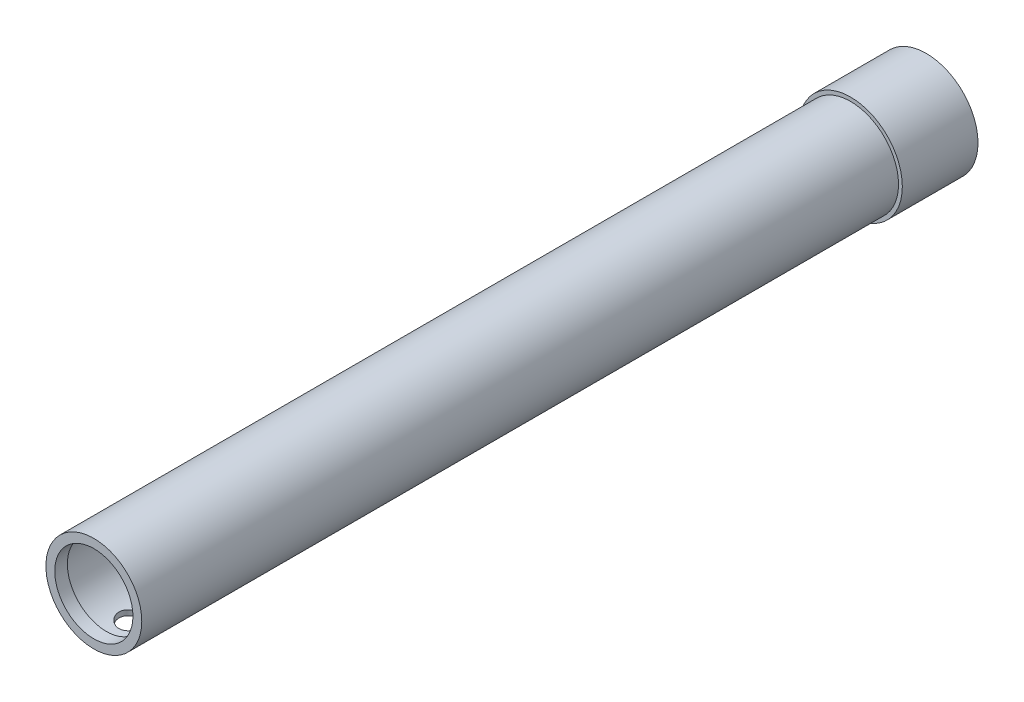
ISO-10303-21;
HEADER;
FILE_DESCRIPTION(('STEP AP214'),'2;1');
FILE_NAME('part.step','',(''),(''),'','','');
FILE_SCHEMA(('AUTOMOTIVE_DESIGN { 1 0 10303 214 1 1 1 1 }'));
ENDSEC;
DATA;
#1=APPLICATION_CONTEXT('core data for automotive mechanical design processes');
#2=APPLICATION_PROTOCOL_DEFINITION('international standard','automotive_design',2000,#1);
#3=PRODUCT_CONTEXT('',#1,'mechanical');
#4=PRODUCT('Part','Part','',(#3));
#5=PRODUCT_RELATED_PRODUCT_CATEGORY('part','',(#4));
#6=PRODUCT_DEFINITION_FORMATION('','',#4);
#7=PRODUCT_DEFINITION_CONTEXT('part definition',#1,'design');
#8=PRODUCT_DEFINITION('design','',#6,#7);
#9=PRODUCT_DEFINITION_SHAPE('','',#8);
#10=(LENGTH_UNIT() NAMED_UNIT(*) SI_UNIT(.MILLI.,.METRE.));
#11=(NAMED_UNIT(*) PLANE_ANGLE_UNIT() SI_UNIT($,.RADIAN.));
#12=(NAMED_UNIT(*) SI_UNIT($,.STERADIAN.) SOLID_ANGLE_UNIT());
#13=UNCERTAINTY_MEASURE_WITH_UNIT(LENGTH_MEASURE(1.E-05),#10,'distance_accuracy_value','');
#14=(GEOMETRIC_REPRESENTATION_CONTEXT(3) GLOBAL_UNCERTAINTY_ASSIGNED_CONTEXT((#13)) GLOBAL_UNIT_ASSIGNED_CONTEXT((#10,
#11,#12)) REPRESENTATION_CONTEXT('',''));
#15=CARTESIAN_POINT('',(0.,0.,0.));
#16=DIRECTION('',(0.,0.,1.));
#17=DIRECTION('',(1.,0.,0.));
#18=AXIS2_PLACEMENT_3D('',#15,#16,#17);
#19=CARTESIAN_POINT('',(0.,0.,300.));
#20=DIRECTION('',(0.,0.,-1.));
#21=DIRECTION('',(-1.,0.,0.));
#22=AXIS2_PLACEMENT_3D('',#19,#20,#21);
#23=CYLINDRICAL_SURFACE('',#22,19.);
#24=CARTESIAN_POINT('',(0.,-19.,290.));
#25=CARTESIAN_POINT('',(0.275769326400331,-18.9999957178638,289.999993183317));
#26=CARTESIAN_POINT('',(0.551612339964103,-18.9939369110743,289.977108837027));
#27=CARTESIAN_POINT('',(1.09536084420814,-18.9703552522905,289.886332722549));
#28=CARTESIAN_POINT('',(1.36326229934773,-18.9528266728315,289.81841846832));
#29=CARTESIAN_POINT('',(1.88319959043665,-18.9082415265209,289.639936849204));
#30=CARTESIAN_POINT('',(2.13525511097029,-18.8811970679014,289.529423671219));
#31=CARTESIAN_POINT('',(2.61725305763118,-18.8204430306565,289.269079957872));
#32=CARTESIAN_POINT('',(2.84719416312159,-18.7867330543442,289.119247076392));
#33=CARTESIAN_POINT('',(3.2836398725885,-18.7154388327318,288.780936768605));
#34=CARTESIAN_POINT('',(3.48957269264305,-18.6777897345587,288.591735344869));
#35=CARTESIAN_POINT('',(3.86718169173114,-18.6032800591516,288.181606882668));
#36=CARTESIAN_POINT('',(4.03885358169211,-18.5664195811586,287.960675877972));
#37=CARTESIAN_POINT('',(4.34583417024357,-18.4969993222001,287.488822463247));
#38=CARTESIAN_POINT('',(4.48048899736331,-18.4645214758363,287.237461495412));
#39=CARTESIAN_POINT('',(4.7054029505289,-18.4084956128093,286.714675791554));
#40=CARTESIAN_POINT('',(4.79567002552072,-18.3849459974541,286.443254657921));
#41=CARTESIAN_POINT('',(4.92726790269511,-18.3501118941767,285.894376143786));
#42=CARTESIAN_POINT('',(4.96963355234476,-18.3385684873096,285.617183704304));
#43=CARTESIAN_POINT('',(5.00745164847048,-18.328279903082,285.059403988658));
#44=CARTESIAN_POINT('',(5.00291261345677,-18.3295324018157,284.778817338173));
#45=CARTESIAN_POINT('',(4.94787263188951,-18.3444621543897,284.230259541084));
#46=CARTESIAN_POINT('',(4.89861973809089,-18.3578020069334,283.962152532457));
#47=CARTESIAN_POINT('',(4.75754734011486,-18.3948637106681,283.438147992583));
#48=CARTESIAN_POINT('',(4.66572451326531,-18.4185863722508,283.182251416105));
#49=CARTESIAN_POINT('',(4.44109179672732,-18.4740402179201,282.68665842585));
#50=CARTESIAN_POINT('',(4.30784106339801,-18.5058568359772,282.447171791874));
#51=CARTESIAN_POINT('',(4.00444274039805,-18.573867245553,281.993517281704));
#52=CARTESIAN_POINT('',(3.83428805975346,-18.6100618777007,281.779354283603));
#53=CARTESIAN_POINT('',(3.45551254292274,-18.6841580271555,281.375291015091));
#54=CARTESIAN_POINT('',(3.24584253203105,-18.7220772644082,281.186376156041));
#55=CARTESIAN_POINT('',(2.79733618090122,-18.794319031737,280.846190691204));
#56=CARTESIAN_POINT('',(2.55849875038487,-18.828641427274,280.694921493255));
#57=CARTESIAN_POINT('',(2.05693717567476,-18.8900243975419,280.433903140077));
#58=CARTESIAN_POINT('',(1.79411828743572,-18.9170543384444,280.324328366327));
#59=CARTESIAN_POINT('',(1.25291705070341,-18.9605851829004,280.151199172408));
#60=CARTESIAN_POINT('',(0.974538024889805,-18.9770883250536,280.087634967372));
#61=CARTESIAN_POINT('',(0.418531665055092,-18.9973691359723,280.009869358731));
#62=CARTESIAN_POINT('',(0.14110409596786,-19.0014922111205,279.994327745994));
#63=CARTESIAN_POINT('',(-0.412392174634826,-18.9975393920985,280.009352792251));
#64=CARTESIAN_POINT('',(-0.688461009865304,-18.9894647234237,280.039914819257));
#65=CARTESIAN_POINT('',(-1.22664703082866,-18.9622464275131,280.145179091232));
#66=CARTESIAN_POINT('',(-1.48892004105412,-18.9432894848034,280.21913734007));
#67=CARTESIAN_POINT('',(-1.99731390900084,-18.8964538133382,280.408233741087));
#68=CARTESIAN_POINT('',(-2.24343303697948,-18.8685741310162,280.523376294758));
#69=CARTESIAN_POINT('',(-2.71776721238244,-18.8061722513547,280.794082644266));
#70=CARTESIAN_POINT('',(-2.9455476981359,-18.7715327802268,280.950380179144));
#71=CARTESIAN_POINT('',(-3.37211945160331,-18.6996172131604,281.298034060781));
#72=CARTESIAN_POINT('',(-3.57090513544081,-18.6623406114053,281.489397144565));
#73=CARTESIAN_POINT('',(-3.93946537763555,-18.5880870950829,281.907998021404));
#74=CARTESIAN_POINT('',(-4.10829545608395,-18.5511463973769,282.136075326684));
#75=CARTESIAN_POINT('',(-4.40530154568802,-18.4828739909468,282.618100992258));
#76=CARTESIAN_POINT('',(-4.53347928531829,-18.451542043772,282.872048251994));
#77=CARTESIAN_POINT('',(-4.74457728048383,-18.3983923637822,283.39731246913));
#78=CARTESIAN_POINT('',(-4.82776168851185,-18.3765192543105,283.668517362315));
#79=CARTESIAN_POINT('',(-4.94715371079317,-18.3447420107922,284.22173645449));
#80=CARTESIAN_POINT('',(-4.98337294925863,-18.3348349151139,284.50374796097));
#81=CARTESIAN_POINT('',(-5.00715081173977,-18.3283542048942,285.060918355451));
#82=CARTESIAN_POINT('',(-4.99622557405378,-18.3313651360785,285.336008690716));
#83=CARTESIAN_POINT('',(-4.9295314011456,-18.3494111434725,285.880276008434));
#84=CARTESIAN_POINT('',(-4.87376356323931,-18.3644459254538,286.149453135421));
#85=CARTESIAN_POINT('',(-4.71983552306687,-18.404601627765,286.672400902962));
#86=CARTESIAN_POINT('',(-4.62198864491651,-18.4296479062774,286.926269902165));
#87=CARTESIAN_POINT('',(-4.38692411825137,-18.487008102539,287.414178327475));
#88=CARTESIAN_POINT('',(-4.24970044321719,-18.5193231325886,287.648214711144));
#89=CARTESIAN_POINT('',(-3.93514861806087,-18.5887388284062,288.097070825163));
#90=CARTESIAN_POINT('',(-3.75678207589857,-18.6259502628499,288.311145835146));
#91=CARTESIAN_POINT('',(-3.36699304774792,-18.7003384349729,288.706818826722));
#92=CARTESIAN_POINT('',(-3.15556257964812,-18.7375151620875,288.888408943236));
#93=CARTESIAN_POINT('',(-2.70037417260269,-18.8085635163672,289.217640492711));
#94=CARTESIAN_POINT('',(-2.45603841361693,-18.8423509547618,289.36450271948));
#95=CARTESIAN_POINT('',(-1.94526775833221,-18.9019003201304,289.614834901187));
#96=CARTESIAN_POINT('',(-1.67884754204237,-18.9276675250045,289.718333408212));
#97=CARTESIAN_POINT('',(-1.1777515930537,-18.9648374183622,289.865096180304));
#98=CARTESIAN_POINT('',(-0.945286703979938,-18.9779285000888,289.915569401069));
#99=CARTESIAN_POINT('',(-0.475232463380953,-18.9955112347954,289.983022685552));
#100=CARTESIAN_POINT('',(-0.237643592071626,-19.0000036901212,290.000005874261));
#101=CARTESIAN_POINT('',(0.,-19.,290.));
#102=B_SPLINE_CURVE_WITH_KNOTS('',3,(#24,#25,#26,#27,#28,#29,#30,#31,#32,#33,#34,#35,#36,#37,
#38,#39,#40,#41,#42,#43,#44,#45,#46,#47,#48,#49,#50,#51,#52,#53,#54,#55,#56,#57,#58,#59,#60,#61,
#62,#63,#64,#65,#66,#67,#68,#69,#70,#71,#72,#73,#74,#75,#76,#77,#78,#79,#80,#81,#82,#83,#84,#85,
#86,#87,#88,#89,#90,#91,#92,#93,#94,#95,#96,#97,#98,#99,#100,#101),.UNSPECIFIED.,.T.,.F.,(4,2,2,
2,2,2,2,2,2,2,2,2,2,2,2,2,2,2,2,2,2,2,2,2,2,2,2,2,2,2,2,2,2,2,2,2,2,2,4),(0.,0.826436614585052,
1.65328622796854,2.47908752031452,3.30493809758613,4.14758534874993,4.99033802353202,
5.84713921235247,6.70378690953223,7.54155141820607,8.37916378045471,9.19409222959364,
10.0090842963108,10.8330642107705,11.6572025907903,12.5074895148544,13.35780823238,
14.2116451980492,15.0653005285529,15.8949065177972,16.7244291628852,17.5401294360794,
18.3559169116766,19.187369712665,20.0189824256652,20.873388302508,21.7277578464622,
22.5770554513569,23.4261428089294,24.2481310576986,25.0700991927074,25.8860500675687,
26.7021258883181,27.5416338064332,28.3813447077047,29.2384104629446,30.0949110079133,
30.8071573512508,31.5193372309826),.UNSPECIFIED.);
#103=CARTESIAN_POINT('',(0.,-19.,290.));
#104=VERTEX_POINT('',#103);
#105=EDGE_CURVE('E82',#104,#104,#102,.T.);
#106=ORIENTED_EDGE('',*,*,#105,.T.);
#107=EDGE_LOOP('',(#106));
#108=FACE_BOUND('',#107,.T.);
#109=CARTESIAN_POINT('',(0.,0.,300.));
#110=DIRECTION('',(0.,0.,1.));
#111=DIRECTION('',(1.,0.,0.));
#112=AXIS2_PLACEMENT_3D('',#109,#110,#111);
#113=CIRCLE('',#112,19.);
#114=CARTESIAN_POINT('',(19.,0.,300.));
#115=VERTEX_POINT('',#114);
#116=EDGE_CURVE('E53',#115,#115,#113,.T.);
#117=ORIENTED_EDGE('',*,*,#116,.F.);
#118=EDGE_LOOP('',(#117));
#119=FACE_BOUND('',#118,.T.);
#120=CARTESIAN_POINT('',(0.,0.,0.));
#121=DIRECTION('',(0.,0.,1.));
#122=DIRECTION('',(1.,0.,0.));
#123=AXIS2_PLACEMENT_3D('',#120,#121,#122);
#124=CIRCLE('',#123,19.);
#125=CARTESIAN_POINT('',(19.,0.,0.));
#126=VERTEX_POINT('',#125);
#127=EDGE_CURVE('E58',#126,#126,#124,.T.);
#128=ORIENTED_EDGE('',*,*,#127,.T.);
#129=EDGE_LOOP('',(#128));
#130=FACE_BOUND('',#129,.T.);
#131=ADVANCED_FACE('F39',(#108,#119,#130),#23,.T.);
#132=CARTESIAN_POINT('',(0.,0.,300.));
#133=DIRECTION('',(0.,0.,1.));
#134=DIRECTION('',(1.,0.,0.));
#135=AXIS2_PLACEMENT_3D('',#132,#133,#134);
#136=PLANE('',#135);
#137=ORIENTED_EDGE('',*,*,#116,.T.);
#138=EDGE_LOOP('',(#137));
#139=FACE_BOUND('',#138,.T.);
#140=CARTESIAN_POINT('',(0.,0.,300.));
#141=DIRECTION('',(0.,0.,1.));
#142=DIRECTION('',(1.,0.,0.));
#143=AXIS2_PLACEMENT_3D('',#140,#141,#142);
#144=CIRCLE('',#143,15.5);
#145=CARTESIAN_POINT('',(15.5,0.,300.));
#146=VERTEX_POINT('',#145);
#147=EDGE_CURVE('E78',#146,#146,#144,.T.);
#148=ORIENTED_EDGE('',*,*,#147,.F.);
#149=EDGE_LOOP('',(#148));
#150=FACE_BOUND('',#149,.T.);
#151=ADVANCED_FACE('F124',(#139,#150),#136,.T.);
#152=CARTESIAN_POINT('',(0.,0.,-30.));
#153=DIRECTION('',(0.,0.,1.));
#154=DIRECTION('',(1.,0.,0.));
#155=AXIS2_PLACEMENT_3D('',#152,#153,#154);
#156=CYLINDRICAL_SURFACE('',#155,20.5);
#157=CARTESIAN_POINT('',(0.,0.,-30.));
#158=DIRECTION('',(0.,0.,1.));
#159=DIRECTION('',(1.,0.,0.));
#160=AXIS2_PLACEMENT_3D('',#157,#158,#159);
#161=CIRCLE('',#160,20.5);
#162=CARTESIAN_POINT('',(20.5,0.,-30.));
#163=VERTEX_POINT('',#162);
#164=EDGE_CURVE('E63',#163,#163,#161,.T.);
#165=ORIENTED_EDGE('',*,*,#164,.T.);
#166=EDGE_LOOP('',(#165));
#167=FACE_BOUND('',#166,.T.);
#168=CARTESIAN_POINT('',(0.,0.,0.));
#169=DIRECTION('',(0.,0.,1.));
#170=DIRECTION('',(1.,0.,0.));
#171=AXIS2_PLACEMENT_3D('',#168,#169,#170);
#172=CIRCLE('',#171,20.5);
#173=CARTESIAN_POINT('',(20.5,0.,0.));
#174=VERTEX_POINT('',#173);
#175=EDGE_CURVE('E65',#174,#174,#172,.T.);
#176=ORIENTED_EDGE('',*,*,#175,.F.);
#177=EDGE_LOOP('',(#176));
#178=FACE_BOUND('',#177,.T.);
#179=ADVANCED_FACE('F118',(#167,#178),#156,.T.);
#180=CARTESIAN_POINT('',(0.,0.,-30.));
#181=DIRECTION('',(0.,0.,1.));
#182=DIRECTION('',(1.,0.,0.));
#183=AXIS2_PLACEMENT_3D('',#180,#181,#182);
#184=PLANE('',#183);
#185=CARTESIAN_POINT('',(0.,0.,-30.));
#186=DIRECTION('',(0.,0.,-1.));
#187=DIRECTION('',(-1.,0.,0.));
#188=AXIS2_PLACEMENT_3D('',#185,#186,#187);
#189=CIRCLE('',#188,17.25);
#190=CARTESIAN_POINT('',(-17.25,0.,-30.));
#191=VERTEX_POINT('',#190);
#192=EDGE_CURVE('E196',#191,#191,#189,.T.);
#193=ORIENTED_EDGE('',*,*,#192,.F.);
#194=EDGE_LOOP('',(#193));
#195=FACE_BOUND('',#194,.T.);
#196=ORIENTED_EDGE('',*,*,#164,.F.);
#197=EDGE_LOOP('',(#196));
#198=FACE_BOUND('',#197,.T.);
#199=ADVANCED_FACE('F115',(#195,#198),#184,.F.);
#200=CARTESIAN_POINT('',(0.,0.,0.));
#201=DIRECTION('',(0.,0.,1.));
#202=DIRECTION('',(1.,0.,0.));
#203=AXIS2_PLACEMENT_3D('',#200,#201,#202);
#204=PLANE('',#203);
#205=ORIENTED_EDGE('',*,*,#127,.F.);
#206=EDGE_LOOP('',(#205));
#207=FACE_BOUND('',#206,.T.);
#208=ORIENTED_EDGE('',*,*,#175,.T.);
#209=EDGE_LOOP('',(#208));
#210=FACE_BOUND('',#209,.T.);
#211=ADVANCED_FACE('F109',(#207,#210),#204,.T.);
#212=CARTESIAN_POINT('',(0.,0.,295.));
#213=DIRECTION('',(0.,0.,1.));
#214=DIRECTION('',(1.,0.,0.));
#215=AXIS2_PLACEMENT_3D('',#212,#213,#214);
#216=PLANE('',#215);
#217=CARTESIAN_POINT('',(0.,0.,295.));
#218=DIRECTION('',(0.,0.,1.));
#219=DIRECTION('',(1.,0.,0.));
#220=AXIS2_PLACEMENT_3D('',#217,#218,#219);
#221=CIRCLE('',#220,15.5);
#222=CARTESIAN_POINT('',(15.5,0.,295.));
#223=VERTEX_POINT('',#222);
#224=EDGE_CURVE('E69',#223,#223,#221,.T.);
#225=ORIENTED_EDGE('',*,*,#224,.T.);
#226=EDGE_LOOP('',(#225));
#227=FACE_BOUND('',#226,.T.);
#228=CARTESIAN_POINT('',(0.,0.,295.));
#229=DIRECTION('',(0.,0.,1.));
#230=DIRECTION('',(1.,0.,0.));
#231=AXIS2_PLACEMENT_3D('',#228,#229,#230);
#232=CIRCLE('',#231,17.);
#233=CARTESIAN_POINT('',(17.,0.,295.));
#234=VERTEX_POINT('',#233);
#235=EDGE_CURVE('E10',#234,#234,#232,.F.);
#236=ORIENTED_EDGE('',*,*,#235,.T.);
#237=EDGE_LOOP('',(#236));
#238=FACE_BOUND('',#237,.T.);
#239=ADVANCED_FACE('F106',(#227,#238),#216,.F.);
#240=CARTESIAN_POINT('',(0.,0.,295.));
#241=DIRECTION('',(0.,0.,1.));
#242=DIRECTION('',(1.,0.,0.));
#243=AXIS2_PLACEMENT_3D('',#240,#241,#242);
#244=CYLINDRICAL_SURFACE('',#243,15.5);
#245=ORIENTED_EDGE('',*,*,#224,.F.);
#246=EDGE_LOOP('',(#245));
#247=FACE_BOUND('',#246,.T.);
#248=ORIENTED_EDGE('',*,*,#147,.T.);
#249=EDGE_LOOP('',(#248));
#250=FACE_BOUND('',#249,.T.);
#251=ADVANCED_FACE('F102',(#247,#250),#244,.F.);
#252=CARTESIAN_POINT('',(0.,0.,0.));
#253=DIRECTION('',(0.,0.,1.));
#254=DIRECTION('',(1.,0.,0.));
#255=AXIS2_PLACEMENT_3D('',#252,#253,#254);
#256=CYLINDRICAL_SURFACE('',#255,17.);
#257=CARTESIAN_POINT('',(0.,-17.,290.));
#258=CARTESIAN_POINT('',(-0.274542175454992,-16.9999972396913,289.999996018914));
#259=CARTESIAN_POINT('',(-0.549124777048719,-16.9932854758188,289.977312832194));
#260=CARTESIAN_POINT('',(-1.09030958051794,-16.9671658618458,289.887384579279));
#261=CARTESIAN_POINT('',(-1.35690910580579,-16.9477538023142,289.820124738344));
#262=CARTESIAN_POINT('',(-1.87424279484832,-16.8983635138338,289.643471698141));
#263=CARTESIAN_POINT('',(-2.12499922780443,-16.8684005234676,289.534139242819));
#264=CARTESIAN_POINT('',(-2.60462027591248,-16.8010321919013,289.276689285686));
#265=CARTESIAN_POINT('',(-2.83348222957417,-16.7636259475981,289.128567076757));
#266=CARTESIAN_POINT('',(-3.26915832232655,-16.6842112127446,288.793416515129));
#267=CARTESIAN_POINT('',(-3.47528005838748,-16.6421111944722,288.605509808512));
#268=CARTESIAN_POINT('',(-3.85358695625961,-16.558607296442,288.197997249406));
#269=CARTESIAN_POINT('',(-4.02576667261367,-16.5172035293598,287.978386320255));
#270=CARTESIAN_POINT('',(-4.33489560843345,-16.4388177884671,287.507902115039));
#271=CARTESIAN_POINT('',(-4.47100870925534,-16.4019498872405,287.256458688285));
#272=CARTESIAN_POINT('',(-4.69873934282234,-16.3381741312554,286.732992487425));
#273=CARTESIAN_POINT('',(-4.79036709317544,-16.311263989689,286.460974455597));
#274=CARTESIAN_POINT('',(-4.92404618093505,-16.2714028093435,285.911837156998));
#275=CARTESIAN_POINT('',(-4.96737026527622,-16.2580942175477,285.635054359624));
#276=CARTESIAN_POINT('',(-5.0071854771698,-16.245878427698,285.077853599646));
#277=CARTESIAN_POINT('',(-5.00368745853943,-16.2469678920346,284.797436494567));
#278=CARTESIAN_POINT('',(-4.95095940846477,-16.2631076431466,284.251198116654));
#279=CARTESIAN_POINT('',(-4.90331354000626,-16.2776742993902,283.985207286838));
#280=CARTESIAN_POINT('',(-4.76619765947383,-16.3183462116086,283.465174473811));
#281=CARTESIAN_POINT('',(-4.67672366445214,-16.3444525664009,283.211133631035));
#282=CARTESIAN_POINT('',(-4.45730211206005,-16.4056554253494,282.718290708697));
#283=CARTESIAN_POINT('',(-4.326833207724,-16.4408666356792,282.479735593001));
#284=CARTESIAN_POINT('',(-4.02948792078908,-16.5162554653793,282.02736924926));
#285=CARTESIAN_POINT('',(-3.86260301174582,-16.5564342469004,281.813563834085));
#286=CARTESIAN_POINT('',(-3.48925235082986,-16.6392021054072,281.407768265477));
#287=CARTESIAN_POINT('',(-3.28146894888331,-16.6818232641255,281.216994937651));
#288=CARTESIAN_POINT('',(-2.8363291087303,-16.7632443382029,280.87272397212));
#289=CARTESIAN_POINT('',(-2.59897095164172,-16.8020440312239,280.719228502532));
#290=CARTESIAN_POINT('',(-2.09926848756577,-16.8717818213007,280.453169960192));
#291=CARTESIAN_POINT('',(-1.83677785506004,-16.9026694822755,280.340867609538));
#292=CARTESIAN_POINT('',(-1.29551766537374,-16.9527396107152,280.16235794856));
#293=CARTESIAN_POINT('',(-1.01675248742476,-16.9719252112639,280.096138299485));
#294=CARTESIAN_POINT('',(-0.461208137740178,-16.9959379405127,280.013678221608));
#295=CARTESIAN_POINT('',(-0.184693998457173,-17.0012389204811,279.995787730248));
#296=CARTESIAN_POINT('',(0.367399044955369,-16.9982701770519,280.005881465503));
#297=CARTESIAN_POINT('',(0.64297806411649,-16.9900021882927,280.033859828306));
#298=CARTESIAN_POINT('',(1.17921271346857,-16.961134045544,280.1335588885));
#299=CARTESIAN_POINT('',(1.44006199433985,-16.9408036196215,280.204323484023));
#300=CARTESIAN_POINT('',(1.9461351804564,-16.8901536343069,280.386443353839));
#301=CARTESIAN_POINT('',(2.19135723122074,-16.8598328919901,280.497803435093));
#302=CARTESIAN_POINT('',(2.66534944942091,-16.7915033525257,280.760775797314));
#303=CARTESIAN_POINT('',(2.8936244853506,-16.7533367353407,280.913238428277));
#304=CARTESIAN_POINT('',(3.32191560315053,-16.673704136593,281.253048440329));
#305=CARTESIAN_POINT('',(3.52192485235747,-16.6322373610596,281.440404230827));
#306=CARTESIAN_POINT('',(3.89521688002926,-16.5488725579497,281.852428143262));
#307=CARTESIAN_POINT('',(4.06732704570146,-16.5070097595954,282.078168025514));
#308=CARTESIAN_POINT('',(4.37129517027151,-16.4291353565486,282.556232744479));
#309=CARTESIAN_POINT('',(4.50315434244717,-16.3931235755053,282.808556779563));
#310=CARTESIAN_POINT('',(4.72194711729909,-16.3314467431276,283.331714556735));
#311=CARTESIAN_POINT('',(4.80910325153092,-16.3057305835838,283.60244886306));
#312=CARTESIAN_POINT('',(4.93634927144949,-16.26766584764,284.155642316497));
#313=CARTESIAN_POINT('',(4.97645449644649,-16.2553129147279,284.438097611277));
#314=CARTESIAN_POINT('',(5.00744547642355,-16.2457908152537,284.994567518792));
#315=CARTESIAN_POINT('',(5.00023747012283,-16.2480335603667,285.268467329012));
#316=CARTESIAN_POINT('',(4.94133317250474,-16.2660429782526,285.810964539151));
#317=CARTESIAN_POINT('',(4.88963853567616,-16.2818091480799,286.079562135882));
#318=CARTESIAN_POINT('',(4.74443717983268,-16.3247022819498,286.600847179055));
#319=CARTESIAN_POINT('',(4.65141659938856,-16.3516969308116,286.853681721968));
#320=CARTESIAN_POINT('',(4.42658103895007,-16.413985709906,287.340356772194));
#321=CARTESIAN_POINT('',(4.29475886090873,-16.4492813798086,287.574193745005));
#322=CARTESIAN_POINT('',(3.99063021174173,-16.525744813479,288.025129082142));
#323=CARTESIAN_POINT('',(3.81706300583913,-16.5670754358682,288.241349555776));
#324=CARTESIAN_POINT('',(3.43666397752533,-16.6501406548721,288.64221382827));
#325=CARTESIAN_POINT('',(3.2298236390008,-16.6918753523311,288.826849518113));
#326=CARTESIAN_POINT('',(2.78184131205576,-16.7724327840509,289.164392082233));
#327=CARTESIAN_POINT('',(2.53990743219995,-16.8111427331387,289.316277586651));
#328=CARTESIAN_POINT('',(2.03279874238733,-16.8799593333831,289.576998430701));
#329=CARTESIAN_POINT('',(1.76763565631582,-16.9100702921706,289.685855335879));
#330=CARTESIAN_POINT('',(1.25377523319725,-16.9554297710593,289.846835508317));
#331=CARTESIAN_POINT('',(1.00680227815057,-16.97200860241,289.90412084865));
#332=CARTESIAN_POINT('',(0.506563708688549,-16.9942941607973,289.980702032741));
#333=CARTESIAN_POINT('',(0.253299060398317,-17.0000025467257,290.000003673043));
#334=CARTESIAN_POINT('',(0.,-17.,290.));
#335=B_SPLINE_CURVE_WITH_KNOTS('',3,(#257,#258,#259,#260,#261,#262,#263,#264,#265,#266,#267,
#268,#269,#270,#271,#272,#273,#274,#275,#276,#277,#278,#279,#280,#281,#282,#283,#284,#285,#286,
#287,#288,#289,#290,#291,#292,#293,#294,#295,#296,#297,#298,#299,#300,#301,#302,#303,#304,#305,
#306,#307,#308,#309,#310,#311,#312,#313,#314,#315,#316,#317,#318,#319,#320,#321,#322,#323,#324,
#325,#326,#327,#328,#329,#330,#331,#332,#333,#334),.UNSPECIFIED.,.T.,.F.,(4,2,2,2,2,2,2,2,2,2,2,
2,2,2,2,2,2,2,2,2,2,2,2,2,2,2,2,2,2,2,2,2,2,2,2,2,2,2,4),(0.,0.822696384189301,1.64566558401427,
2.46745102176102,3.28933622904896,4.13172361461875,4.97424603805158,5.83486437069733,
6.69528493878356,7.53245524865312,8.3694314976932,9.17749119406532,9.98562785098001,
10.8044888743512,11.623541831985,12.4754016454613,13.3273109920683,14.18452287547,
15.0415051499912,15.8688347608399,16.6960586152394,17.5054473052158,18.3149318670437,
19.1426539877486,19.9705758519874,20.8273157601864,21.6840298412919,22.5364367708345,
23.3885657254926,24.2065793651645,25.024562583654,25.8331682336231,26.6419239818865,
27.4791225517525,28.3165357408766,29.1771614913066,30.0373553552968,30.796510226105,
31.5555492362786),.UNSPECIFIED.);
#336=CARTESIAN_POINT('',(0.,-17.,290.));
#337=VERTEX_POINT('',#336);
#338=EDGE_CURVE('E43',#337,#337,#335,.T.);
#339=ORIENTED_EDGE('',*,*,#338,.T.);
#340=EDGE_LOOP('',(#339));
#341=FACE_BOUND('',#340,.T.);
#342=CARTESIAN_POINT('',(0.,0.,0.));
#343=DIRECTION('',(0.,0.,1.));
#344=DIRECTION('',(1.,0.,0.));
#345=AXIS2_PLACEMENT_3D('',#342,#343,#344);
#346=CIRCLE('',#345,17.);
#347=CARTESIAN_POINT('',(17.,0.,0.));
#348=VERTEX_POINT('',#347);
#349=EDGE_CURVE('E73',#348,#348,#346,.T.);
#350=ORIENTED_EDGE('',*,*,#349,.F.);
#351=EDGE_LOOP('',(#350));
#352=FACE_BOUND('',#351,.T.);
#353=ORIENTED_EDGE('',*,*,#235,.F.);
#354=EDGE_LOOP('',(#353));
#355=FACE_BOUND('',#354,.T.);
#356=ADVANCED_FACE('F99',(#341,#352,#355),#256,.F.);
#357=CARTESIAN_POINT('',(0.,-20.5,285.));
#358=DIRECTION('',(0.,1.,0.));
#359=DIRECTION('',(0.,0.,1.));
#360=AXIS2_PLACEMENT_3D('',#357,#358,#359);
#361=CYLINDRICAL_SURFACE('',#360,5.);
#362=ORIENTED_EDGE('',*,*,#338,.F.);
#363=EDGE_LOOP('',(#362));
#364=FACE_BOUND('',#363,.T.);
#365=ORIENTED_EDGE('',*,*,#105,.F.);
#366=EDGE_LOOP('',(#365));
#367=FACE_BOUND('',#366,.T.);
#368=ADVANCED_FACE('F93',(#364,#367),#361,.F.);
#369=CARTESIAN_POINT('',(0.,0.,0.));
#370=DIRECTION('',(0.,0.,1.));
#371=DIRECTION('',(1.,0.,0.));
#372=AXIS2_PLACEMENT_3D('',#369,#370,#371);
#373=PLANE('',#372);
#374=ORIENTED_EDGE('',*,*,#349,.T.);
#375=EDGE_LOOP('',(#374));
#376=FACE_BOUND('',#375,.T.);
#377=CARTESIAN_POINT('',(0.,0.,0.));
#378=DIRECTION('',(0.,0.,1.));
#379=DIRECTION('',(1.,0.,0.));
#380=AXIS2_PLACEMENT_3D('',#377,#378,#379);
#381=CIRCLE('',#380,17.25);
#382=CARTESIAN_POINT('',(-17.25,0.,0.));
#383=VERTEX_POINT('',#382);
#384=EDGE_CURVE('E77',#383,#383,#381,.F.);
#385=ORIENTED_EDGE('',*,*,#384,.T.);
#386=EDGE_LOOP('',(#385));
#387=FACE_BOUND('',#386,.T.);
#388=ADVANCED_FACE('F98',(#376,#387),#373,.F.);
#389=CARTESIAN_POINT('',(0.,0.,48.7903679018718));
#390=DIRECTION('',(0.,0.,-1.));
#391=DIRECTION('',(-1.,0.,0.));
#392=AXIS2_PLACEMENT_3D('',#389,#390,#391);
#393=CYLINDRICAL_SURFACE('',#392,17.25);
#394=CARTESIAN_POINT('',(-17.25,0.,-30.));
#395=CARTESIAN_POINT('',(-17.25,0.,-29.6875));
#396=CARTESIAN_POINT('',(-17.25,0.,-29.375));
#397=CARTESIAN_POINT('',(-17.25,0.,-28.75));
#398=CARTESIAN_POINT('',(-17.25,0.,-28.4375));
#399=CARTESIAN_POINT('',(-17.25,0.,-27.8125));
#400=CARTESIAN_POINT('',(-17.25,0.,-27.5));
#401=CARTESIAN_POINT('',(-17.25,0.,-26.875));
#402=CARTESIAN_POINT('',(-17.25,0.,-26.5625));
#403=CARTESIAN_POINT('',(-17.25,0.,-25.9375));
#404=CARTESIAN_POINT('',(-17.25,0.,-25.625));
#405=CARTESIAN_POINT('',(-17.25,0.,-25.));
#406=CARTESIAN_POINT('',(-17.25,0.,-24.6875));
#407=CARTESIAN_POINT('',(-17.25,0.,-24.0625));
#408=CARTESIAN_POINT('',(-17.25,0.,-23.75));
#409=CARTESIAN_POINT('',(-17.25,0.,-23.125));
#410=CARTESIAN_POINT('',(-17.25,0.,-22.8125));
#411=CARTESIAN_POINT('',(-17.25,0.,-22.1875));
#412=CARTESIAN_POINT('',(-17.25,0.,-21.875));
#413=CARTESIAN_POINT('',(-17.25,0.,-21.25));
#414=CARTESIAN_POINT('',(-17.25,0.,-20.9375));
#415=CARTESIAN_POINT('',(-17.25,0.,-20.3125));
#416=CARTESIAN_POINT('',(-17.25,0.,-20.));
#417=CARTESIAN_POINT('',(-17.25,0.,-19.375));
#418=CARTESIAN_POINT('',(-17.25,0.,-19.0625));
#419=CARTESIAN_POINT('',(-17.25,0.,-18.4375));
#420=CARTESIAN_POINT('',(-17.25,0.,-18.125));
#421=CARTESIAN_POINT('',(-17.25,0.,-17.5));
#422=CARTESIAN_POINT('',(-17.25,0.,-17.1875));
#423=CARTESIAN_POINT('',(-17.25,0.,-16.5625));
#424=CARTESIAN_POINT('',(-17.25,0.,-16.25));
#425=CARTESIAN_POINT('',(-17.25,0.,-15.625));
#426=CARTESIAN_POINT('',(-17.25,0.,-15.3125));
#427=CARTESIAN_POINT('',(-17.25,0.,-14.6875));
#428=CARTESIAN_POINT('',(-17.25,0.,-14.375));
#429=CARTESIAN_POINT('',(-17.25,0.,-13.75));
#430=CARTESIAN_POINT('',(-17.25,0.,-13.4375));
#431=CARTESIAN_POINT('',(-17.25,0.,-12.8125));
#432=CARTESIAN_POINT('',(-17.25,0.,-12.5));
#433=CARTESIAN_POINT('',(-17.25,0.,-11.875));
#434=CARTESIAN_POINT('',(-17.25,0.,-11.5625));
#435=CARTESIAN_POINT('',(-17.25,0.,-10.9375));
#436=CARTESIAN_POINT('',(-17.25,0.,-10.625));
#437=CARTESIAN_POINT('',(-17.25,0.,-10.));
#438=CARTESIAN_POINT('',(-17.25,0.,-9.6875));
#439=CARTESIAN_POINT('',(-17.25,0.,-9.0625));
#440=CARTESIAN_POINT('',(-17.25,0.,-8.75000000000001));
#441=CARTESIAN_POINT('',(-17.25,0.,-8.12500000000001));
#442=CARTESIAN_POINT('',(-17.25,0.,-7.8125));
#443=CARTESIAN_POINT('',(-17.25,0.,-7.1875));
#444=CARTESIAN_POINT('',(-17.25,0.,-6.875));
#445=CARTESIAN_POINT('',(-17.25,0.,-6.25000000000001));
#446=CARTESIAN_POINT('',(-17.25,0.,-5.93750000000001));
#447=CARTESIAN_POINT('',(-17.25,0.,-5.3125));
#448=CARTESIAN_POINT('',(-17.25,0.,-5.));
#449=CARTESIAN_POINT('',(-17.25,0.,-4.375));
#450=CARTESIAN_POINT('',(-17.25,0.,-4.0625));
#451=CARTESIAN_POINT('',(-17.25,0.,-3.4375));
#452=CARTESIAN_POINT('',(-17.25,0.,-3.125));
#453=CARTESIAN_POINT('',(-17.25,0.,-2.5));
#454=CARTESIAN_POINT('',(-17.25,0.,-2.18750000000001));
#455=CARTESIAN_POINT('',(-17.25,0.,-1.56250000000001));
#456=CARTESIAN_POINT('',(-17.25,0.,-1.25000000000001));
#457=CARTESIAN_POINT('',(-17.25,0.,-0.625000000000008));
#458=CARTESIAN_POINT('',(-17.25,0.,-0.312500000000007));
#459=CARTESIAN_POINT('',(-17.25,0.,0.));
#460=B_SPLINE_CURVE_WITH_KNOTS('',3,(#394,#395,#396,#397,#398,#399,#400,#401,#402,#403,#404,
#405,#406,#407,#408,#409,#410,#411,#412,#413,#414,#415,#416,#417,#418,#419,#420,#421,#422,#423,
#424,#425,#426,#427,#428,#429,#430,#431,#432,#433,#434,#435,#436,#437,#438,#439,#440,#441,#442,
#443,#444,#445,#446,#447,#448,#449,#450,#451,#452,#453,#454,#455,#456,#457,#458,#459),
.UNSPECIFIED.,.F.,.F.,(4,2,2,2,2,2,2,2,2,2,2,2,2,2,2,2,2,2,2,2,2,2,2,2,2,2,2,2,2,2,2,2,4),(0.,
0.937499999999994,1.875,2.8125,3.75,4.6875,5.62499999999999,6.5625,7.49999999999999,8.4375,
9.37499999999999,10.3125,11.25,12.1875,13.125,14.0625,15.,15.9375,16.875,17.8125,18.75,19.6875,
20.625,21.5625,22.5,23.4375,24.375,25.3125,26.25,27.1875,28.125,29.0625,30.),.UNSPECIFIED.);
#461=EDGE_CURVE('BSEAM181',#191,#383,#460,.T.);
#462=ORIENTED_EDGE('',*,*,#192,.T.);
#463=ORIENTED_EDGE('',*,*,#384,.F.);
#464=ORIENTED_EDGE('',*,*,#461,.T.);
#465=ORIENTED_EDGE('',*,*,#461,.F.);
#466=EDGE_LOOP('',(#462,#464,#463,#465));
#467=FACE_BOUND('',#466,.T.);
#468=ADVANCED_FACE('F181',(#467),#393,.F.);
#469=CLOSED_SHELL('',(#131,#151,#179,#199,#211,#239,#251,#356,#368,#388,#468));
#470=MANIFOLD_SOLID_BREP('B2',#469);
#471=ADVANCED_BREP_SHAPE_REPRESENTATION('',(#18,#470),#14);
#472=SHAPE_DEFINITION_REPRESENTATION(#9,#471);
ENDSEC;
END-ISO-10303-21;
